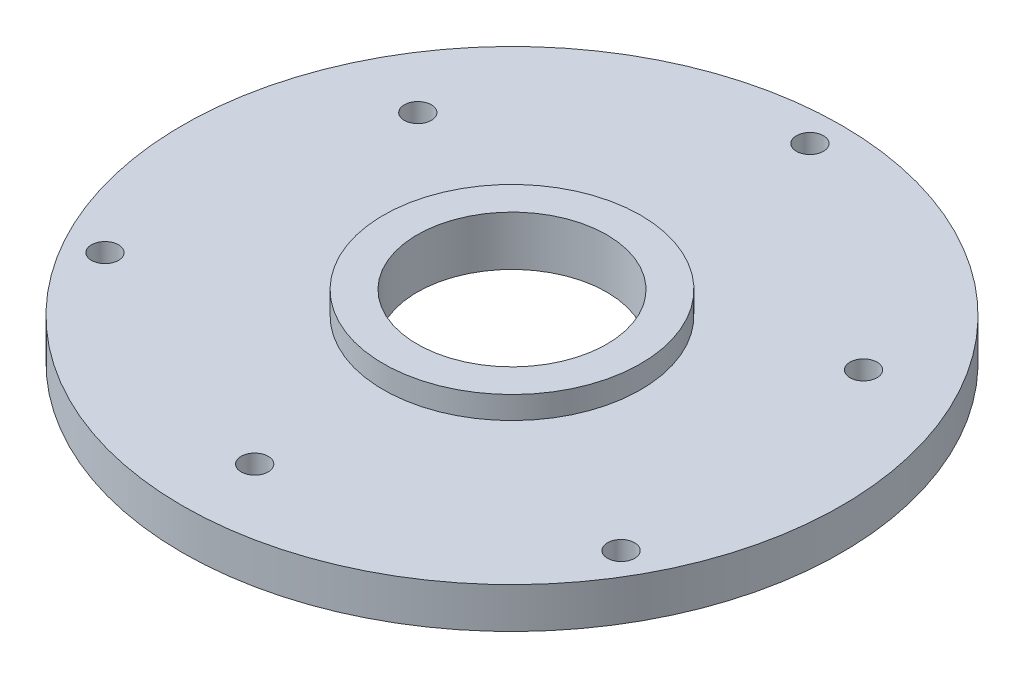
ISO-10303-21;
HEADER;
FILE_DESCRIPTION(('STEP AP214'),'2;1');
FILE_NAME('part.step','',(''),(''),'','','');
FILE_SCHEMA(('AUTOMOTIVE_DESIGN { 1 0 10303 214 1 1 1 1 }'));
ENDSEC;
DATA;
#1=APPLICATION_CONTEXT('core data for automotive mechanical design processes');
#2=APPLICATION_PROTOCOL_DEFINITION('international standard','automotive_design',2000,#1);
#3=PRODUCT_CONTEXT('',#1,'mechanical');
#4=PRODUCT('Part','Part','',(#3));
#5=PRODUCT_RELATED_PRODUCT_CATEGORY('part','',(#4));
#6=PRODUCT_DEFINITION_FORMATION('','',#4);
#7=PRODUCT_DEFINITION_CONTEXT('part definition',#1,'design');
#8=PRODUCT_DEFINITION('design','',#6,#7);
#9=PRODUCT_DEFINITION_SHAPE('','',#8);
#10=(LENGTH_UNIT() NAMED_UNIT(*) SI_UNIT(.MILLI.,.METRE.));
#11=(NAMED_UNIT(*) PLANE_ANGLE_UNIT() SI_UNIT($,.RADIAN.));
#12=(NAMED_UNIT(*) SI_UNIT($,.STERADIAN.) SOLID_ANGLE_UNIT());
#13=UNCERTAINTY_MEASURE_WITH_UNIT(LENGTH_MEASURE(1.E-05),#10,'distance_accuracy_value','');
#14=(GEOMETRIC_REPRESENTATION_CONTEXT(3) GLOBAL_UNCERTAINTY_ASSIGNED_CONTEXT((#13)) GLOBAL_UNIT_ASSIGNED_CONTEXT((#10,
#11,#12)) REPRESENTATION_CONTEXT('',''));
#15=CARTESIAN_POINT('',(0.,0.,0.));
#16=DIRECTION('',(0.,0.,1.));
#17=DIRECTION('',(1.,0.,0.));
#18=AXIS2_PLACEMENT_3D('',#15,#16,#17);
#19=CARTESIAN_POINT('',(0.,0.,0.));
#20=DIRECTION('',(0.,-1.,0.));
#21=DIRECTION('',(0.,0.,-1.));
#22=AXIS2_PLACEMENT_3D('',#19,#20,#21);
#23=CYLINDRICAL_SURFACE('',#22,14.25);
#24=CARTESIAN_POINT('',(0.,41.3859311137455,0.));
#25=DIRECTION('',(0.,-1.,0.));
#26=DIRECTION('',(0.,0.,-1.));
#27=AXIS2_PLACEMENT_3D('',#24,#25,#26);
#28=CIRCLE('',#27,14.25);
#29=CARTESIAN_POINT('',(0.,41.3859311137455,-14.25));
#30=VERTEX_POINT('',#29);
#31=EDGE_CURVE('E10',#30,#30,#28,.T.);
#32=ORIENTED_EDGE('',*,*,#31,.T.);
#33=EDGE_LOOP('',(#32));
#34=FACE_BOUND('',#33,.T.);
#35=CARTESIAN_POINT('',(0.,38.8859311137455,0.));
#36=DIRECTION('',(0.,-1.,0.));
#37=DIRECTION('',(0.,0.,-1.));
#38=AXIS2_PLACEMENT_3D('',#35,#36,#37);
#39=CIRCLE('',#38,14.25);
#40=CARTESIAN_POINT('',(0.,38.8859311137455,-14.25));
#41=VERTEX_POINT('',#40);
#42=EDGE_CURVE('E85',#41,#41,#39,.T.);
#43=ORIENTED_EDGE('',*,*,#42,.F.);
#44=EDGE_LOOP('',(#43));
#45=FACE_BOUND('',#44,.T.);
#46=ADVANCED_FACE('F41',(#34,#45),#23,.T.);
#47=CARTESIAN_POINT('',(10.5,41.3859311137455,0.));
#48=DIRECTION('',(0.,1.,0.));
#49=DIRECTION('',(0.,0.,1.));
#50=AXIS2_PLACEMENT_3D('',#47,#48,#49);
#51=PLANE('',#50);
#52=CARTESIAN_POINT('',(0.,41.3859311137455,0.));
#53=DIRECTION('',(0.,-1.,0.));
#54=DIRECTION('',(0.,0.,-1.));
#55=AXIS2_PLACEMENT_3D('',#52,#53,#54);
#56=CIRCLE('',#55,10.5);
#57=CARTESIAN_POINT('',(0.,41.3859311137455,-10.5));
#58=VERTEX_POINT('',#57);
#59=EDGE_CURVE('E49',#58,#58,#56,.T.);
#60=ORIENTED_EDGE('',*,*,#59,.T.);
#61=EDGE_LOOP('',(#60));
#62=FACE_BOUND('',#61,.T.);
#63=ORIENTED_EDGE('',*,*,#31,.F.);
#64=EDGE_LOOP('',(#63));
#65=FACE_BOUND('',#64,.T.);
#66=ADVANCED_FACE('F124',(#62,#65),#51,.T.);
#67=CARTESIAN_POINT('',(0.,0.,0.));
#68=DIRECTION('',(0.,-1.,0.));
#69=DIRECTION('',(0.,0.,-1.));
#70=AXIS2_PLACEMENT_3D('',#67,#68,#69);
#71=CYLINDRICAL_SURFACE('',#70,10.5);
#72=CARTESIAN_POINT('',(0.,35.8859311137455,0.));
#73=DIRECTION('',(0.,-1.,0.));
#74=DIRECTION('',(0.,0.,-1.));
#75=AXIS2_PLACEMENT_3D('',#72,#73,#74);
#76=CIRCLE('',#75,10.5);
#77=CARTESIAN_POINT('',(0.,35.8859311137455,-10.5));
#78=VERTEX_POINT('',#77);
#79=EDGE_CURVE('E55',#78,#78,#76,.T.);
#80=ORIENTED_EDGE('',*,*,#79,.T.);
#81=EDGE_LOOP('',(#80));
#82=FACE_BOUND('',#81,.T.);
#83=ORIENTED_EDGE('',*,*,#59,.F.);
#84=EDGE_LOOP('',(#83));
#85=FACE_BOUND('',#84,.T.);
#86=ADVANCED_FACE('F109',(#82,#85),#71,.F.);
#87=CARTESIAN_POINT('',(17.5,35.8859311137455,0.));
#88=DIRECTION('',(0.,-1.,0.));
#89=DIRECTION('',(0.,0.,-1.));
#90=AXIS2_PLACEMENT_3D('',#87,#88,#89);
#91=PLANE('',#90);
#92=CARTESIAN_POINT('',(0.,35.8859311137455,0.));
#93=DIRECTION('',(0.,-1.,0.));
#94=DIRECTION('',(0.,0.,-1.));
#95=AXIS2_PLACEMENT_3D('',#92,#93,#94);
#96=CIRCLE('',#95,17.5);
#97=CARTESIAN_POINT('',(0.,35.8859311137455,-17.5));
#98=VERTEX_POINT('',#97);
#99=EDGE_CURVE('E102',#98,#98,#96,.T.);
#100=ORIENTED_EDGE('',*,*,#99,.T.);
#101=EDGE_LOOP('',(#100));
#102=FACE_BOUND('',#101,.T.);
#103=ORIENTED_EDGE('',*,*,#79,.F.);
#104=EDGE_LOOP('',(#103));
#105=FACE_BOUND('',#104,.T.);
#106=ADVANCED_FACE('F112',(#102,#105),#91,.T.);
#107=CARTESIAN_POINT('',(0.,0.,0.));
#108=DIRECTION('',(0.,-1.,0.));
#109=DIRECTION('',(0.,0.,-1.));
#110=AXIS2_PLACEMENT_3D('',#107,#108,#109);
#111=CYLINDRICAL_SURFACE('',#110,17.5);
#112=CARTESIAN_POINT('',(0.,34.3859311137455,0.));
#113=DIRECTION('',(0.,-1.,0.));
#114=DIRECTION('',(0.,0.,-1.));
#115=AXIS2_PLACEMENT_3D('',#112,#113,#114);
#116=CIRCLE('',#115,17.5);
#117=CARTESIAN_POINT('',(0.,34.3859311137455,-17.5));
#118=VERTEX_POINT('',#117);
#119=EDGE_CURVE('E98',#118,#118,#116,.T.);
#120=ORIENTED_EDGE('',*,*,#119,.T.);
#121=EDGE_LOOP('',(#120));
#122=FACE_BOUND('',#121,.T.);
#123=ORIENTED_EDGE('',*,*,#99,.F.);
#124=EDGE_LOOP('',(#123));
#125=FACE_BOUND('',#124,.T.);
#126=ADVANCED_FACE('F114',(#122,#125),#111,.F.);
#127=CARTESIAN_POINT('',(17.5,34.3859311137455,0.));
#128=DIRECTION('',(0.,-1.,0.));
#129=DIRECTION('',(0.,0.,-1.));
#130=AXIS2_PLACEMENT_3D('',#127,#128,#129);
#131=PLANE('',#130);
#132=CARTESIAN_POINT('',(0.,34.3859311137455,28.5));
#133=DIRECTION('',(0.,-1.,0.));
#134=DIRECTION('',(0.,0.,-1.));
#135=AXIS2_PLACEMENT_3D('',#132,#133,#134);
#136=CIRCLE('',#135,1.5);
#137=CARTESIAN_POINT('',(0.,34.3859311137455,27.));
#138=VERTEX_POINT('',#137);
#139=EDGE_CURVE('E63',#138,#138,#136,.T.);
#140=ORIENTED_EDGE('',*,*,#139,.F.);
#141=EDGE_LOOP('',(#140));
#142=FACE_BOUND('',#141,.T.);
#143=CARTESIAN_POINT('',(24.6817240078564,34.3859311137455,-14.2500000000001));
#144=DIRECTION('',(0.,-1.,0.));
#145=DIRECTION('',(0.,0.,-1.));
#146=AXIS2_PLACEMENT_3D('',#143,#144,#145);
#147=CIRCLE('',#146,1.5);
#148=CARTESIAN_POINT('',(24.6817240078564,34.3859311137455,-15.7500000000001));
#149=VERTEX_POINT('',#148);
#150=EDGE_CURVE('E185',#149,#149,#147,.T.);
#151=ORIENTED_EDGE('',*,*,#150,.F.);
#152=EDGE_LOOP('',(#151));
#153=FACE_BOUND('',#152,.T.);
#154=CARTESIAN_POINT('',(-24.6817240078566,34.3859311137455,-14.2499999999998));
#155=DIRECTION('',(0.,-1.,0.));
#156=DIRECTION('',(0.,0.,-1.));
#157=AXIS2_PLACEMENT_3D('',#154,#155,#156);
#158=CIRCLE('',#157,1.5);
#159=CARTESIAN_POINT('',(-24.6817240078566,34.3859311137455,-15.7499999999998));
#160=VERTEX_POINT('',#159);
#161=EDGE_CURVE('E189',#160,#160,#158,.T.);
#162=ORIENTED_EDGE('',*,*,#161,.F.);
#163=EDGE_LOOP('',(#162));
#164=FACE_BOUND('',#163,.T.);
#165=CARTESIAN_POINT('',(0.,34.3859311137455,-33.));
#166=DIRECTION('',(0.,1.,0.));
#167=DIRECTION('',(0.,0.,1.));
#168=AXIS2_PLACEMENT_3D('',#165,#166,#167);
#169=CIRCLE('',#168,1.5);
#170=CARTESIAN_POINT('',(0.,34.3859311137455,-31.5));
#171=VERTEX_POINT('',#170);
#172=EDGE_CURVE('E90',#171,#171,#169,.T.);
#173=ORIENTED_EDGE('',*,*,#172,.T.);
#174=EDGE_LOOP('',(#173));
#175=FACE_BOUND('',#174,.T.);
#176=CARTESIAN_POINT('',(28.5788383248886,34.3859311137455,16.4999999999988));
#177=DIRECTION('',(0.,1.,0.));
#178=DIRECTION('',(0.,0.,1.));
#179=AXIS2_PLACEMENT_3D('',#176,#177,#178);
#180=CIRCLE('',#179,1.5000000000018);
#181=CARTESIAN_POINT('',(28.5788383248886,34.3859311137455,18.0000000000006));
#182=VERTEX_POINT('',#181);
#183=EDGE_CURVE('E202',#182,#182,#180,.T.);
#184=ORIENTED_EDGE('',*,*,#183,.T.);
#185=EDGE_LOOP('',(#184));
#186=FACE_BOUND('',#185,.T.);
#187=CARTESIAN_POINT('',(-28.5788383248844,34.3859311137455,16.5000000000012));
#188=DIRECTION('',(0.,1.,0.));
#189=DIRECTION('',(0.,0.,1.));
#190=AXIS2_PLACEMENT_3D('',#187,#188,#189);
#191=CIRCLE('',#190,1.50000000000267);
#192=CARTESIAN_POINT('',(-28.5788383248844,34.3859311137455,18.0000000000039));
#193=VERTEX_POINT('',#192);
#194=EDGE_CURVE('E75',#193,#193,#191,.T.);
#195=ORIENTED_EDGE('',*,*,#194,.T.);
#196=EDGE_LOOP('',(#195));
#197=FACE_BOUND('',#196,.T.);
#198=CARTESIAN_POINT('',(0.,34.3859311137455,0.));
#199=DIRECTION('',(0.,-1.,0.));
#200=DIRECTION('',(0.,0.,-1.));
#201=AXIS2_PLACEMENT_3D('',#198,#199,#200);
#202=CIRCLE('',#201,36.5);
#203=CARTESIAN_POINT('',(0.,34.3859311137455,-36.5));
#204=VERTEX_POINT('',#203);
#205=EDGE_CURVE('E94',#204,#204,#202,.T.);
#206=ORIENTED_EDGE('',*,*,#205,.T.);
#207=EDGE_LOOP('',(#206));
#208=FACE_BOUND('',#207,.T.);
#209=ORIENTED_EDGE('',*,*,#119,.F.);
#210=EDGE_LOOP('',(#209));
#211=FACE_BOUND('',#210,.T.);
#212=ADVANCED_FACE('F121',(#142,#153,#164,#175,#186,#197,#208,#211),#131,.T.);
#213=CARTESIAN_POINT('',(0.,0.,0.));
#214=DIRECTION('',(0.,-1.,0.));
#215=DIRECTION('',(0.,0.,-1.));
#216=AXIS2_PLACEMENT_3D('',#213,#214,#215);
#217=CYLINDRICAL_SURFACE('',#216,36.5);
#218=CARTESIAN_POINT('',(0.,38.8859311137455,0.));
#219=DIRECTION('',(0.,-1.,0.));
#220=DIRECTION('',(0.,0.,-1.));
#221=AXIS2_PLACEMENT_3D('',#218,#219,#220);
#222=CIRCLE('',#221,36.5);
#223=CARTESIAN_POINT('',(0.,38.8859311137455,-36.5));
#224=VERTEX_POINT('',#223);
#225=EDGE_CURVE('E89',#224,#224,#222,.T.);
#226=ORIENTED_EDGE('',*,*,#225,.T.);
#227=EDGE_LOOP('',(#226));
#228=FACE_BOUND('',#227,.T.);
#229=ORIENTED_EDGE('',*,*,#205,.F.);
#230=EDGE_LOOP('',(#229));
#231=FACE_BOUND('',#230,.T.);
#232=ADVANCED_FACE('F138',(#228,#231),#217,.T.);
#233=CARTESIAN_POINT('',(14.25,38.8859311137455,0.));
#234=DIRECTION('',(0.,1.,0.));
#235=DIRECTION('',(0.,0.,1.));
#236=AXIS2_PLACEMENT_3D('',#233,#234,#235);
#237=PLANE('',#236);
#238=CARTESIAN_POINT('',(0.,38.8859311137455,28.5));
#239=DIRECTION('',(0.,1.,0.));
#240=DIRECTION('',(0.,0.,1.));
#241=AXIS2_PLACEMENT_3D('',#238,#239,#240);
#242=CIRCLE('',#241,1.5);
#243=CARTESIAN_POINT('',(0.,38.8859311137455,27.));
#244=VERTEX_POINT('',#243);
#245=EDGE_CURVE('E44',#244,#244,#242,.T.);
#246=ORIENTED_EDGE('',*,*,#245,.F.);
#247=EDGE_LOOP('',(#246));
#248=FACE_BOUND('',#247,.T.);
#249=CARTESIAN_POINT('',(24.6817240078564,38.8859311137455,-14.2500000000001));
#250=DIRECTION('',(0.,1.,0.));
#251=DIRECTION('',(0.,0.,1.));
#252=AXIS2_PLACEMENT_3D('',#249,#250,#251);
#253=CIRCLE('',#252,1.5);
#254=CARTESIAN_POINT('',(24.6817240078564,38.8859311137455,-15.7500000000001));
#255=VERTEX_POINT('',#254);
#256=EDGE_CURVE('E62',#255,#255,#253,.T.);
#257=ORIENTED_EDGE('',*,*,#256,.F.);
#258=EDGE_LOOP('',(#257));
#259=FACE_BOUND('',#258,.T.);
#260=CARTESIAN_POINT('',(-24.6817240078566,38.8859311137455,-14.2499999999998));
#261=DIRECTION('',(0.,1.,0.));
#262=DIRECTION('',(0.,0.,1.));
#263=AXIS2_PLACEMENT_3D('',#260,#261,#262);
#264=CIRCLE('',#263,1.5);
#265=CARTESIAN_POINT('',(-24.6817240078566,38.8859311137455,-15.7499999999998));
#266=VERTEX_POINT('',#265);
#267=EDGE_CURVE('E59',#266,#266,#264,.T.);
#268=ORIENTED_EDGE('',*,*,#267,.F.);
#269=EDGE_LOOP('',(#268));
#270=FACE_BOUND('',#269,.T.);
#271=CARTESIAN_POINT('',(0.,38.8859311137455,-33.));
#272=DIRECTION('',(0.,1.,0.));
#273=DIRECTION('',(0.,0.,1.));
#274=AXIS2_PLACEMENT_3D('',#271,#272,#273);
#275=CIRCLE('',#274,1.5);
#276=CARTESIAN_POINT('',(0.,38.8859311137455,-31.5));
#277=VERTEX_POINT('',#276);
#278=EDGE_CURVE('E198',#277,#277,#275,.T.);
#279=ORIENTED_EDGE('',*,*,#278,.F.);
#280=EDGE_LOOP('',(#279));
#281=FACE_BOUND('',#280,.T.);
#282=CARTESIAN_POINT('',(28.5788383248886,38.8859311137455,16.4999999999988));
#283=DIRECTION('',(0.,1.,0.));
#284=DIRECTION('',(0.,0.,1.));
#285=AXIS2_PLACEMENT_3D('',#282,#283,#284);
#286=CIRCLE('',#285,1.5000000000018);
#287=CARTESIAN_POINT('',(28.5788383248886,38.8859311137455,18.0000000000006));
#288=VERTEX_POINT('',#287);
#289=EDGE_CURVE('E81',#288,#288,#286,.T.);
#290=ORIENTED_EDGE('',*,*,#289,.F.);
#291=EDGE_LOOP('',(#290));
#292=FACE_BOUND('',#291,.T.);
#293=CARTESIAN_POINT('',(-28.5788383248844,38.8859311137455,16.5000000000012));
#294=DIRECTION('',(0.,1.,0.));
#295=DIRECTION('',(0.,0.,1.));
#296=AXIS2_PLACEMENT_3D('',#293,#294,#295);
#297=CIRCLE('',#296,1.50000000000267);
#298=CARTESIAN_POINT('',(-28.5788383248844,38.8859311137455,18.0000000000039));
#299=VERTEX_POINT('',#298);
#300=EDGE_CURVE('E70',#299,#299,#297,.T.);
#301=ORIENTED_EDGE('',*,*,#300,.F.);
#302=EDGE_LOOP('',(#301));
#303=FACE_BOUND('',#302,.T.);
#304=ORIENTED_EDGE('',*,*,#42,.T.);
#305=EDGE_LOOP('',(#304));
#306=FACE_BOUND('',#305,.T.);
#307=ORIENTED_EDGE('',*,*,#225,.F.);
#308=EDGE_LOOP('',(#307));
#309=FACE_BOUND('',#308,.T.);
#310=ADVANCED_FACE('F134',(#248,#259,#270,#281,#292,#303,#306,#309),#237,.T.);
#311=CARTESIAN_POINT('',(-28.5788383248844,34.3859311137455,16.5000000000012));
#312=DIRECTION('',(0.,1.,0.));
#313=DIRECTION('',(0.,0.,1.));
#314=AXIS2_PLACEMENT_3D('',#311,#312,#313);
#315=CYLINDRICAL_SURFACE('',#314,1.50000000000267);
#316=ORIENTED_EDGE('',*,*,#194,.F.);
#317=EDGE_LOOP('',(#316));
#318=FACE_BOUND('',#317,.T.);
#319=ORIENTED_EDGE('',*,*,#300,.T.);
#320=EDGE_LOOP('',(#319));
#321=FACE_BOUND('',#320,.T.);
#322=ADVANCED_FACE('F137',(#318,#321),#315,.F.);
#323=CARTESIAN_POINT('',(28.5788383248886,34.3859311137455,16.4999999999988));
#324=DIRECTION('',(0.,1.,0.));
#325=DIRECTION('',(0.,0.,1.));
#326=AXIS2_PLACEMENT_3D('',#323,#324,#325);
#327=CYLINDRICAL_SURFACE('',#326,1.5000000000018);
#328=ORIENTED_EDGE('',*,*,#183,.F.);
#329=EDGE_LOOP('',(#328));
#330=FACE_BOUND('',#329,.T.);
#331=ORIENTED_EDGE('',*,*,#289,.T.);
#332=EDGE_LOOP('',(#331));
#333=FACE_BOUND('',#332,.T.);
#334=ADVANCED_FACE('F162',(#330,#333),#327,.F.);
#335=CARTESIAN_POINT('',(0.,34.3859311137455,-33.));
#336=DIRECTION('',(0.,1.,0.));
#337=DIRECTION('',(0.,0.,1.));
#338=AXIS2_PLACEMENT_3D('',#335,#336,#337);
#339=CYLINDRICAL_SURFACE('',#338,1.5);
#340=ORIENTED_EDGE('',*,*,#172,.F.);
#341=EDGE_LOOP('',(#340));
#342=FACE_BOUND('',#341,.T.);
#343=ORIENTED_EDGE('',*,*,#278,.T.);
#344=EDGE_LOOP('',(#343));
#345=FACE_BOUND('',#344,.T.);
#346=ADVANCED_FACE('F166',(#342,#345),#339,.F.);
#347=CARTESIAN_POINT('',(-24.6817240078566,41.3859311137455,-14.2499999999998));
#348=DIRECTION('',(0.,-1.,0.));
#349=DIRECTION('',(0.,0.,-1.));
#350=AXIS2_PLACEMENT_3D('',#347,#348,#349);
#351=CYLINDRICAL_SURFACE('',#350,1.5);
#352=CARTESIAN_POINT('',(-24.6817240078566,38.8859311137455,-15.7499999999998));
#353=CARTESIAN_POINT('',(-24.6817240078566,38.8390561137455,-15.7499999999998));
#354=CARTESIAN_POINT('',(-24.6817240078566,38.7921811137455,-15.7499999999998));
#355=CARTESIAN_POINT('',(-24.6817240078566,38.6984311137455,-15.7499999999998));
#356=CARTESIAN_POINT('',(-24.6817240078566,38.6515561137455,-15.7499999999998));
#357=CARTESIAN_POINT('',(-24.6817240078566,38.5578061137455,-15.7499999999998));
#358=CARTESIAN_POINT('',(-24.6817240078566,38.5109311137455,-15.7499999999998));
#359=CARTESIAN_POINT('',(-24.6817240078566,38.4171811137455,-15.7499999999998));
#360=CARTESIAN_POINT('',(-24.6817240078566,38.3703061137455,-15.7499999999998));
#361=CARTESIAN_POINT('',(-24.6817240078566,38.2765561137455,-15.7499999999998));
#362=CARTESIAN_POINT('',(-24.6817240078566,38.2296811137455,-15.7499999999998));
#363=CARTESIAN_POINT('',(-24.6817240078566,38.1359311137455,-15.7499999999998));
#364=CARTESIAN_POINT('',(-24.6817240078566,38.0890561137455,-15.7499999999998));
#365=CARTESIAN_POINT('',(-24.6817240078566,37.9953061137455,-15.7499999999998));
#366=CARTESIAN_POINT('',(-24.6817240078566,37.9484311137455,-15.7499999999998));
#367=CARTESIAN_POINT('',(-24.6817240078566,37.8546811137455,-15.7499999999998));
#368=CARTESIAN_POINT('',(-24.6817240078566,37.8078061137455,-15.7499999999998));
#369=CARTESIAN_POINT('',(-24.6817240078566,37.7140561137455,-15.7499999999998));
#370=CARTESIAN_POINT('',(-24.6817240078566,37.6671811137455,-15.7499999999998));
#371=CARTESIAN_POINT('',(-24.6817240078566,37.5734311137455,-15.7499999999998));
#372=CARTESIAN_POINT('',(-24.6817240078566,37.5265561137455,-15.7499999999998));
#373=CARTESIAN_POINT('',(-24.6817240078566,37.4328061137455,-15.7499999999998));
#374=CARTESIAN_POINT('',(-24.6817240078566,37.3859311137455,-15.7499999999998));
#375=CARTESIAN_POINT('',(-24.6817240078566,37.2921811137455,-15.7499999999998));
#376=CARTESIAN_POINT('',(-24.6817240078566,37.2453061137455,-15.7499999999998));
#377=CARTESIAN_POINT('',(-24.6817240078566,37.1515561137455,-15.7499999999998));
#378=CARTESIAN_POINT('',(-24.6817240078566,37.1046811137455,-15.7499999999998));
#379=CARTESIAN_POINT('',(-24.6817240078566,37.0109311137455,-15.7499999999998));
#380=CARTESIAN_POINT('',(-24.6817240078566,36.9640561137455,-15.7499999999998));
#381=CARTESIAN_POINT('',(-24.6817240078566,36.8703061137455,-15.7499999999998));
#382=CARTESIAN_POINT('',(-24.6817240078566,36.8234311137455,-15.7499999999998));
#383=CARTESIAN_POINT('',(-24.6817240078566,36.7296811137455,-15.7499999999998));
#384=CARTESIAN_POINT('',(-24.6817240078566,36.6828061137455,-15.7499999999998));
#385=CARTESIAN_POINT('',(-24.6817240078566,36.5890561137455,-15.7499999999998));
#386=CARTESIAN_POINT('',(-24.6817240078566,36.5421811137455,-15.7499999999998));
#387=CARTESIAN_POINT('',(-24.6817240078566,36.4484311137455,-15.7499999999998));
#388=CARTESIAN_POINT('',(-24.6817240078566,36.4015561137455,-15.7499999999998));
#389=CARTESIAN_POINT('',(-24.6817240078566,36.3078061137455,-15.7499999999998));
#390=CARTESIAN_POINT('',(-24.6817240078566,36.2609311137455,-15.7499999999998));
#391=CARTESIAN_POINT('',(-24.6817240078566,36.1671811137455,-15.7499999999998));
#392=CARTESIAN_POINT('',(-24.6817240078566,36.1203061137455,-15.7499999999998));
#393=CARTESIAN_POINT('',(-24.6817240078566,36.0265561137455,-15.7499999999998));
#394=CARTESIAN_POINT('',(-24.6817240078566,35.9796811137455,-15.7499999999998));
#395=CARTESIAN_POINT('',(-24.6817240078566,35.8859311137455,-15.7499999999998));
#396=CARTESIAN_POINT('',(-24.6817240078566,35.8390561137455,-15.7499999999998));
#397=CARTESIAN_POINT('',(-24.6817240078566,35.7453061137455,-15.7499999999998));
#398=CARTESIAN_POINT('',(-24.6817240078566,35.6984311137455,-15.7499999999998));
#399=CARTESIAN_POINT('',(-24.6817240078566,35.6046811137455,-15.7499999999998));
#400=CARTESIAN_POINT('',(-24.6817240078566,35.5578061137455,-15.7499999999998));
#401=CARTESIAN_POINT('',(-24.6817240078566,35.4640561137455,-15.7499999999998));
#402=CARTESIAN_POINT('',(-24.6817240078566,35.4171811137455,-15.7499999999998));
#403=CARTESIAN_POINT('',(-24.6817240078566,35.3234311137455,-15.7499999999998));
#404=CARTESIAN_POINT('',(-24.6817240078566,35.2765561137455,-15.7499999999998));
#405=CARTESIAN_POINT('',(-24.6817240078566,35.1828061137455,-15.7499999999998));
#406=CARTESIAN_POINT('',(-24.6817240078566,35.1359311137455,-15.7499999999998));
#407=CARTESIAN_POINT('',(-24.6817240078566,35.0421811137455,-15.7499999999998));
#408=CARTESIAN_POINT('',(-24.6817240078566,34.9953061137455,-15.7499999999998));
#409=CARTESIAN_POINT('',(-24.6817240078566,34.9015561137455,-15.7499999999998));
#410=CARTESIAN_POINT('',(-24.6817240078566,34.8546811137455,-15.7499999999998));
#411=CARTESIAN_POINT('',(-24.6817240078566,34.7609311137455,-15.7499999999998));
#412=CARTESIAN_POINT('',(-24.6817240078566,34.7140561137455,-15.7499999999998));
#413=CARTESIAN_POINT('',(-24.6817240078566,34.6203061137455,-15.7499999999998));
#414=CARTESIAN_POINT('',(-24.6817240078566,34.5734311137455,-15.7499999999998));
#415=CARTESIAN_POINT('',(-24.6817240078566,34.4796811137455,-15.7499999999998));
#416=CARTESIAN_POINT('',(-24.6817240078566,34.4328061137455,-15.7499999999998));
#417=CARTESIAN_POINT('',(-24.6817240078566,34.3859311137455,-15.7499999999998));
#418=B_SPLINE_CURVE_WITH_KNOTS('',3,(#352,#353,#354,#355,#356,#357,#358,#359,#360,#361,#362,
#363,#364,#365,#366,#367,#368,#369,#370,#371,#372,#373,#374,#375,#376,#377,#378,#379,#380,#381,
#382,#383,#384,#385,#386,#387,#388,#389,#390,#391,#392,#393,#394,#395,#396,#397,#398,#399,#400,
#401,#402,#403,#404,#405,#406,#407,#408,#409,#410,#411,#412,#413,#414,#415,#416,#417),
.UNSPECIFIED.,.F.,.F.,(4,2,2,2,2,2,2,2,2,2,2,2,2,2,2,2,2,2,2,2,2,2,2,2,2,2,2,2,2,2,2,2,4),(0.,
0.140624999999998,0.281249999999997,0.421874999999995,0.562499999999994,0.703124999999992,
0.843749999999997,0.984374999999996,1.12499999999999,1.26562499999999,1.40624999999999,1.546875,
1.68749999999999,1.82812499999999,1.96874999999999,2.10937499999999,2.25,2.39062499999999,
2.53124999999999,2.67187499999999,2.81249999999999,2.95312499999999,3.09374999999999,
3.23437499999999,3.37499999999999,3.51562499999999,3.65624999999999,3.79687499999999,
3.93749999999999,4.07812499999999,4.21874999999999,4.35937499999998,4.49999999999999),.UNSPECIFIED.);
#419=EDGE_CURVE('BSEAM170',#266,#160,#418,.T.);
#420=ORIENTED_EDGE('',*,*,#267,.T.);
#421=ORIENTED_EDGE('',*,*,#161,.T.);
#422=ORIENTED_EDGE('',*,*,#419,.T.);
#423=ORIENTED_EDGE('',*,*,#419,.F.);
#424=EDGE_LOOP('',(#420,#422,#421,#423));
#425=FACE_BOUND('',#424,.T.);
#426=ADVANCED_FACE('F170',(#425),#351,.F.);
#427=CARTESIAN_POINT('',(24.6817240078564,41.3859311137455,-14.2500000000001));
#428=DIRECTION('',(0.,-1.,0.));
#429=DIRECTION('',(0.,0.,-1.));
#430=AXIS2_PLACEMENT_3D('',#427,#428,#429);
#431=CYLINDRICAL_SURFACE('',#430,1.5);
#432=CARTESIAN_POINT('',(24.6817240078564,38.8859311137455,-15.7500000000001));
#433=CARTESIAN_POINT('',(24.6817240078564,38.8390561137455,-15.7500000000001));
#434=CARTESIAN_POINT('',(24.6817240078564,38.7921811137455,-15.7500000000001));
#435=CARTESIAN_POINT('',(24.6817240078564,38.6984311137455,-15.7500000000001));
#436=CARTESIAN_POINT('',(24.6817240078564,38.6515561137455,-15.7500000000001));
#437=CARTESIAN_POINT('',(24.6817240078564,38.5578061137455,-15.7500000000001));
#438=CARTESIAN_POINT('',(24.6817240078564,38.5109311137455,-15.7500000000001));
#439=CARTESIAN_POINT('',(24.6817240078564,38.4171811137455,-15.7500000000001));
#440=CARTESIAN_POINT('',(24.6817240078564,38.3703061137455,-15.7500000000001));
#441=CARTESIAN_POINT('',(24.6817240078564,38.2765561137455,-15.7500000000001));
#442=CARTESIAN_POINT('',(24.6817240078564,38.2296811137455,-15.7500000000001));
#443=CARTESIAN_POINT('',(24.6817240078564,38.1359311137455,-15.7500000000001));
#444=CARTESIAN_POINT('',(24.6817240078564,38.0890561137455,-15.7500000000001));
#445=CARTESIAN_POINT('',(24.6817240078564,37.9953061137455,-15.7500000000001));
#446=CARTESIAN_POINT('',(24.6817240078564,37.9484311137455,-15.7500000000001));
#447=CARTESIAN_POINT('',(24.6817240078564,37.8546811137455,-15.7500000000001));
#448=CARTESIAN_POINT('',(24.6817240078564,37.8078061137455,-15.7500000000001));
#449=CARTESIAN_POINT('',(24.6817240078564,37.7140561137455,-15.7500000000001));
#450=CARTESIAN_POINT('',(24.6817240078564,37.6671811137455,-15.7500000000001));
#451=CARTESIAN_POINT('',(24.6817240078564,37.5734311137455,-15.7500000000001));
#452=CARTESIAN_POINT('',(24.6817240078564,37.5265561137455,-15.7500000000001));
#453=CARTESIAN_POINT('',(24.6817240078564,37.4328061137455,-15.7500000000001));
#454=CARTESIAN_POINT('',(24.6817240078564,37.3859311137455,-15.7500000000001));
#455=CARTESIAN_POINT('',(24.6817240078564,37.2921811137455,-15.7500000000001));
#456=CARTESIAN_POINT('',(24.6817240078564,37.2453061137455,-15.7500000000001));
#457=CARTESIAN_POINT('',(24.6817240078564,37.1515561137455,-15.7500000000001));
#458=CARTESIAN_POINT('',(24.6817240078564,37.1046811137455,-15.7500000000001));
#459=CARTESIAN_POINT('',(24.6817240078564,37.0109311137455,-15.7500000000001));
#460=CARTESIAN_POINT('',(24.6817240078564,36.9640561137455,-15.7500000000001));
#461=CARTESIAN_POINT('',(24.6817240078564,36.8703061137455,-15.7500000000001));
#462=CARTESIAN_POINT('',(24.6817240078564,36.8234311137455,-15.7500000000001));
#463=CARTESIAN_POINT('',(24.6817240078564,36.7296811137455,-15.7500000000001));
#464=CARTESIAN_POINT('',(24.6817240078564,36.6828061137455,-15.7500000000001));
#465=CARTESIAN_POINT('',(24.6817240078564,36.5890561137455,-15.7500000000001));
#466=CARTESIAN_POINT('',(24.6817240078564,36.5421811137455,-15.7500000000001));
#467=CARTESIAN_POINT('',(24.6817240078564,36.4484311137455,-15.7500000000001));
#468=CARTESIAN_POINT('',(24.6817240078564,36.4015561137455,-15.7500000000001));
#469=CARTESIAN_POINT('',(24.6817240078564,36.3078061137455,-15.7500000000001));
#470=CARTESIAN_POINT('',(24.6817240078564,36.2609311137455,-15.7500000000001));
#471=CARTESIAN_POINT('',(24.6817240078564,36.1671811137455,-15.7500000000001));
#472=CARTESIAN_POINT('',(24.6817240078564,36.1203061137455,-15.7500000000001));
#473=CARTESIAN_POINT('',(24.6817240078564,36.0265561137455,-15.7500000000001));
#474=CARTESIAN_POINT('',(24.6817240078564,35.9796811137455,-15.7500000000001));
#475=CARTESIAN_POINT('',(24.6817240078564,35.8859311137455,-15.7500000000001));
#476=CARTESIAN_POINT('',(24.6817240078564,35.8390561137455,-15.7500000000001));
#477=CARTESIAN_POINT('',(24.6817240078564,35.7453061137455,-15.7500000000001));
#478=CARTESIAN_POINT('',(24.6817240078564,35.6984311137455,-15.7500000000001));
#479=CARTESIAN_POINT('',(24.6817240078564,35.6046811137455,-15.7500000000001));
#480=CARTESIAN_POINT('',(24.6817240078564,35.5578061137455,-15.7500000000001));
#481=CARTESIAN_POINT('',(24.6817240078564,35.4640561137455,-15.7500000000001));
#482=CARTESIAN_POINT('',(24.6817240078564,35.4171811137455,-15.7500000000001));
#483=CARTESIAN_POINT('',(24.6817240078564,35.3234311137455,-15.7500000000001));
#484=CARTESIAN_POINT('',(24.6817240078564,35.2765561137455,-15.7500000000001));
#485=CARTESIAN_POINT('',(24.6817240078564,35.1828061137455,-15.7500000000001));
#486=CARTESIAN_POINT('',(24.6817240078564,35.1359311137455,-15.7500000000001));
#487=CARTESIAN_POINT('',(24.6817240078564,35.0421811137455,-15.7500000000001));
#488=CARTESIAN_POINT('',(24.6817240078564,34.9953061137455,-15.7500000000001));
#489=CARTESIAN_POINT('',(24.6817240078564,34.9015561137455,-15.7500000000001));
#490=CARTESIAN_POINT('',(24.6817240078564,34.8546811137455,-15.7500000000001));
#491=CARTESIAN_POINT('',(24.6817240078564,34.7609311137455,-15.7500000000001));
#492=CARTESIAN_POINT('',(24.6817240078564,34.7140561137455,-15.7500000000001));
#493=CARTESIAN_POINT('',(24.6817240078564,34.6203061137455,-15.7500000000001));
#494=CARTESIAN_POINT('',(24.6817240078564,34.5734311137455,-15.7500000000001));
#495=CARTESIAN_POINT('',(24.6817240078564,34.4796811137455,-15.7500000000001));
#496=CARTESIAN_POINT('',(24.6817240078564,34.4328061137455,-15.7500000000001));
#497=CARTESIAN_POINT('',(24.6817240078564,34.3859311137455,-15.7500000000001));
#498=B_SPLINE_CURVE_WITH_KNOTS('',3,(#432,#433,#434,#435,#436,#437,#438,#439,#440,#441,#442,
#443,#444,#445,#446,#447,#448,#449,#450,#451,#452,#453,#454,#455,#456,#457,#458,#459,#460,#461,
#462,#463,#464,#465,#466,#467,#468,#469,#470,#471,#472,#473,#474,#475,#476,#477,#478,#479,#480,
#481,#482,#483,#484,#485,#486,#487,#488,#489,#490,#491,#492,#493,#494,#495,#496,#497),
.UNSPECIFIED.,.F.,.F.,(4,2,2,2,2,2,2,2,2,2,2,2,2,2,2,2,2,2,2,2,2,2,2,2,2,2,2,2,2,2,2,2,4),(0.,
0.140624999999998,0.281249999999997,0.421874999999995,0.562499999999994,0.703124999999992,
0.843749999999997,0.984374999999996,1.12499999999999,1.26562499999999,1.40624999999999,1.546875,
1.68749999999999,1.82812499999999,1.96874999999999,2.10937499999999,2.25,2.39062499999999,
2.53124999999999,2.67187499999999,2.81249999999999,2.95312499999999,3.09374999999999,
3.23437499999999,3.37499999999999,3.51562499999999,3.65624999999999,3.79687499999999,
3.93749999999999,4.07812499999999,4.21874999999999,4.35937499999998,4.49999999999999),.UNSPECIFIED.);
#499=EDGE_CURVE('BSEAM174',#255,#149,#498,.T.);
#500=ORIENTED_EDGE('',*,*,#256,.T.);
#501=ORIENTED_EDGE('',*,*,#150,.T.);
#502=ORIENTED_EDGE('',*,*,#499,.T.);
#503=ORIENTED_EDGE('',*,*,#499,.F.);
#504=EDGE_LOOP('',(#500,#502,#501,#503));
#505=FACE_BOUND('',#504,.T.);
#506=ADVANCED_FACE('F174',(#505),#431,.F.);
#507=CARTESIAN_POINT('',(0.,41.3859311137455,28.5));
#508=DIRECTION('',(0.,-1.,0.));
#509=DIRECTION('',(0.,0.,-1.));
#510=AXIS2_PLACEMENT_3D('',#507,#508,#509);
#511=CYLINDRICAL_SURFACE('',#510,1.5);
#512=CARTESIAN_POINT('',(0.,38.8859311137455,27.));
#513=CARTESIAN_POINT('',(0.,38.8390561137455,27.));
#514=CARTESIAN_POINT('',(0.,38.7921811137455,27.));
#515=CARTESIAN_POINT('',(0.,38.6984311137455,27.));
#516=CARTESIAN_POINT('',(0.,38.6515561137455,27.));
#517=CARTESIAN_POINT('',(0.,38.5578061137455,27.));
#518=CARTESIAN_POINT('',(0.,38.5109311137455,27.));
#519=CARTESIAN_POINT('',(0.,38.4171811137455,27.));
#520=CARTESIAN_POINT('',(0.,38.3703061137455,27.));
#521=CARTESIAN_POINT('',(0.,38.2765561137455,27.));
#522=CARTESIAN_POINT('',(0.,38.2296811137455,27.));
#523=CARTESIAN_POINT('',(0.,38.1359311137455,27.));
#524=CARTESIAN_POINT('',(0.,38.0890561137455,27.));
#525=CARTESIAN_POINT('',(0.,37.9953061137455,27.));
#526=CARTESIAN_POINT('',(0.,37.9484311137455,27.));
#527=CARTESIAN_POINT('',(0.,37.8546811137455,27.));
#528=CARTESIAN_POINT('',(0.,37.8078061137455,27.));
#529=CARTESIAN_POINT('',(0.,37.7140561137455,27.));
#530=CARTESIAN_POINT('',(0.,37.6671811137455,27.));
#531=CARTESIAN_POINT('',(0.,37.5734311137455,27.));
#532=CARTESIAN_POINT('',(0.,37.5265561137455,27.));
#533=CARTESIAN_POINT('',(0.,37.4328061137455,27.));
#534=CARTESIAN_POINT('',(0.,37.3859311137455,27.));
#535=CARTESIAN_POINT('',(0.,37.2921811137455,27.));
#536=CARTESIAN_POINT('',(0.,37.2453061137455,27.));
#537=CARTESIAN_POINT('',(0.,37.1515561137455,27.));
#538=CARTESIAN_POINT('',(0.,37.1046811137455,27.));
#539=CARTESIAN_POINT('',(0.,37.0109311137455,27.));
#540=CARTESIAN_POINT('',(0.,36.9640561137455,27.));
#541=CARTESIAN_POINT('',(0.,36.8703061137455,27.));
#542=CARTESIAN_POINT('',(0.,36.8234311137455,27.));
#543=CARTESIAN_POINT('',(0.,36.7296811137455,27.));
#544=CARTESIAN_POINT('',(0.,36.6828061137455,27.));
#545=CARTESIAN_POINT('',(0.,36.5890561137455,27.));
#546=CARTESIAN_POINT('',(0.,36.5421811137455,27.));
#547=CARTESIAN_POINT('',(0.,36.4484311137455,27.));
#548=CARTESIAN_POINT('',(0.,36.4015561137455,27.));
#549=CARTESIAN_POINT('',(0.,36.3078061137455,27.));
#550=CARTESIAN_POINT('',(0.,36.2609311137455,27.));
#551=CARTESIAN_POINT('',(0.,36.1671811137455,27.));
#552=CARTESIAN_POINT('',(0.,36.1203061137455,27.));
#553=CARTESIAN_POINT('',(0.,36.0265561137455,27.));
#554=CARTESIAN_POINT('',(0.,35.9796811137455,27.));
#555=CARTESIAN_POINT('',(0.,35.8859311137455,27.));
#556=CARTESIAN_POINT('',(0.,35.8390561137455,27.));
#557=CARTESIAN_POINT('',(0.,35.7453061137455,27.));
#558=CARTESIAN_POINT('',(0.,35.6984311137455,27.));
#559=CARTESIAN_POINT('',(0.,35.6046811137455,27.));
#560=CARTESIAN_POINT('',(0.,35.5578061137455,27.));
#561=CARTESIAN_POINT('',(0.,35.4640561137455,27.));
#562=CARTESIAN_POINT('',(0.,35.4171811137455,27.));
#563=CARTESIAN_POINT('',(0.,35.3234311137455,27.));
#564=CARTESIAN_POINT('',(0.,35.2765561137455,27.));
#565=CARTESIAN_POINT('',(0.,35.1828061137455,27.));
#566=CARTESIAN_POINT('',(0.,35.1359311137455,27.));
#567=CARTESIAN_POINT('',(0.,35.0421811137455,27.));
#568=CARTESIAN_POINT('',(0.,34.9953061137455,27.));
#569=CARTESIAN_POINT('',(0.,34.9015561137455,27.));
#570=CARTESIAN_POINT('',(0.,34.8546811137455,27.));
#571=CARTESIAN_POINT('',(0.,34.7609311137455,27.));
#572=CARTESIAN_POINT('',(0.,34.7140561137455,27.));
#573=CARTESIAN_POINT('',(0.,34.6203061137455,27.));
#574=CARTESIAN_POINT('',(0.,34.5734311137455,27.));
#575=CARTESIAN_POINT('',(0.,34.4796811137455,27.));
#576=CARTESIAN_POINT('',(0.,34.4328061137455,27.));
#577=CARTESIAN_POINT('',(0.,34.3859311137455,27.));
#578=B_SPLINE_CURVE_WITH_KNOTS('',3,(#512,#513,#514,#515,#516,#517,#518,#519,#520,#521,#522,
#523,#524,#525,#526,#527,#528,#529,#530,#531,#532,#533,#534,#535,#536,#537,#538,#539,#540,#541,
#542,#543,#544,#545,#546,#547,#548,#549,#550,#551,#552,#553,#554,#555,#556,#557,#558,#559,#560,
#561,#562,#563,#564,#565,#566,#567,#568,#569,#570,#571,#572,#573,#574,#575,#576,#577),
.UNSPECIFIED.,.F.,.F.,(4,2,2,2,2,2,2,2,2,2,2,2,2,2,2,2,2,2,2,2,2,2,2,2,2,2,2,2,2,2,2,2,4),(0.,
0.140624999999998,0.281249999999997,0.421874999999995,0.562499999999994,0.703124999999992,
0.843749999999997,0.984374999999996,1.12499999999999,1.26562499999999,1.40624999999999,1.546875,
1.68749999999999,1.82812499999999,1.96874999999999,2.10937499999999,2.25,2.39062499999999,
2.53124999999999,2.67187499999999,2.81249999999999,2.95312499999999,3.09374999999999,
3.23437499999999,3.37499999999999,3.51562499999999,3.65624999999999,3.79687499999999,
3.93749999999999,4.07812499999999,4.21874999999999,4.35937499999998,4.49999999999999),.UNSPECIFIED.);
#579=EDGE_CURVE('BSEAM178',#244,#138,#578,.T.);
#580=ORIENTED_EDGE('',*,*,#245,.T.);
#581=ORIENTED_EDGE('',*,*,#139,.T.);
#582=ORIENTED_EDGE('',*,*,#579,.T.);
#583=ORIENTED_EDGE('',*,*,#579,.F.);
#584=EDGE_LOOP('',(#580,#582,#581,#583));
#585=FACE_BOUND('',#584,.T.);
#586=ADVANCED_FACE('F178',(#585),#511,.F.);
#587=CLOSED_SHELL('',(#46,#66,#86,#106,#126,#212,#232,#310,#322,#334,#346,#426,#506,#586));
#588=MANIFOLD_SOLID_BREP('B2',#587);
#589=ADVANCED_BREP_SHAPE_REPRESENTATION('',(#18,#588),#14);
#590=SHAPE_DEFINITION_REPRESENTATION(#9,#589);
ENDSEC;
END-ISO-10303-21;
